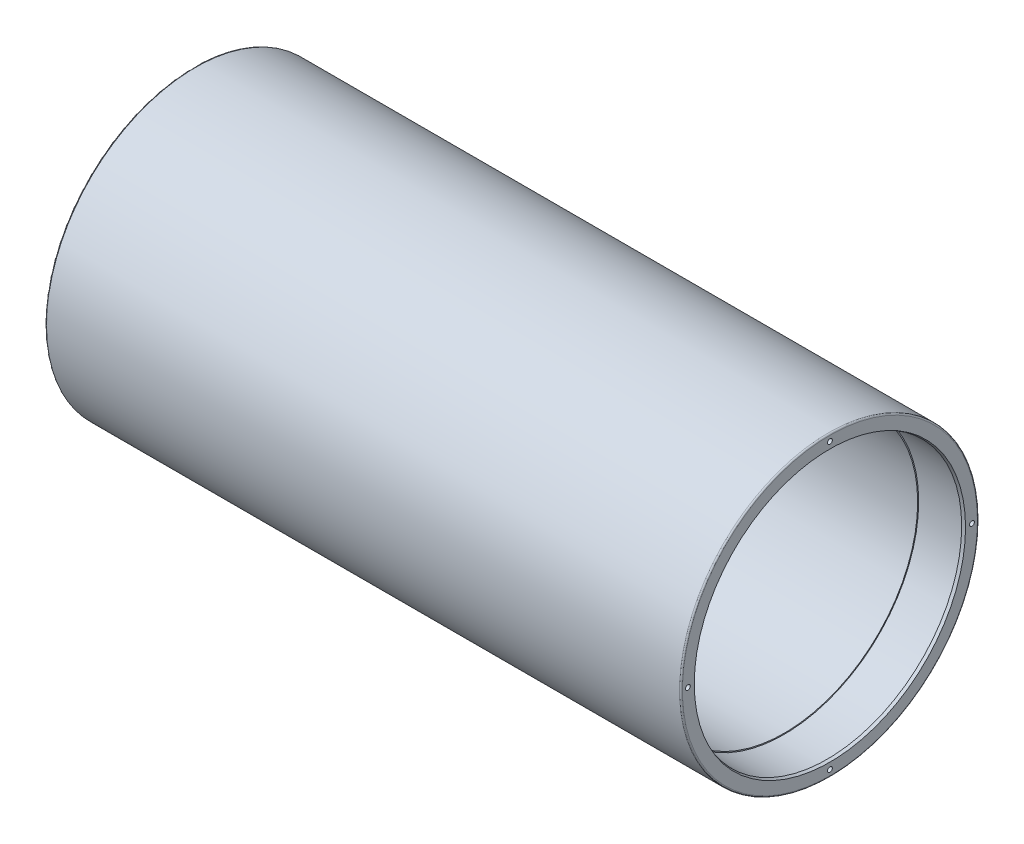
from build123d import *

# Parameters (mm, degrees)
SKETCH5_W         = 38.573447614
SKETCH5_H         = 6.968946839
CIRPATTERN1_COUNT = 4
CHAMFER1_SIZE     = 1.5748
CHAMFER1_SIZE2    = 0.573180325
CHAMFER2_SIZE     = 1.5748
CHAMFER2_SIZE2    = 0.573180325
FILLET1_R         = 0.79375


with BuildPart() as part:
    # Sketch2 → Revolve1 (revolve)
    with BuildSketch(Plane.XY, mode=Mode.PRIVATE) as revolve1_sk:
        Polygon((0, 82.55), (0, 66.675), (18.569070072, 66.675), (46.05935632, 74.041), (352.425, 74.041), (352.425, 82.55), align=None)
    revolve(revolve1_sk.sketch.rotate(Axis((196.985032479, 0, 0), (-1, 0, 0)), 90), axis=Axis((196.985032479, 0, 0), (-1, 0, 0)))

    # Sketch5 → Cut-Revolve1 (revolve, cut)
    with BuildSketch(Plane.XY, mode=Mode.PRIVATE) as cut_revolve1_sk:
        with Locations((346.311723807, 71.128026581)):
            Rectangle(SKETCH5_W, SKETCH5_H)
    revolve(cut_revolve1_sk.sketch.rotate(Axis((0, 0, 0), (1, 0, 0)), 270), axis=Axis((0, 0, 0), (1, 0, 0)), mode=Mode.SUBTRACT)

    # Sketch4 → 6-32 Tapped Hole1 (revolve, cut)
    with BuildSketch(Plane.ZX.offset(78.74)):
        Polygon((0, 0), (0, 10.21069403), (1.35255, 9.398), (1.35255, 0), align=None)
    f_6_32_tapped_hole1 = revolve(axis=Axis((-6.35, 78.74, 0), (1, 0, 0)), mode=Mode.SUBTRACT)

    # CirPattern1: 6-32 Tapped Hole1 ×4 about axis
    cirpattern1_axis = Axis((0, 0, 0), (1, 0, 0))
    for i in range(1, CIRPATTERN1_COUNT):
        add(f_6_32_tapped_hole1.rotate(cirpattern1_axis, i * 360 / CIRPATTERN1_COUNT), mode=Mode.SUBTRACT)

    # Mirror1: 6-32 Tapped Hole1 across plane
    add(f_6_32_tapped_hole1.mirror(Plane.ZY.offset(-176.2125)), mode=Mode.SUBTRACT)

    # Mirror1 copy 1 sketch → Mirror1 copy 1 (revolve, cut)
    with BuildSketch(Plane(origin=(352.425, 0, 78.74), x_dir=(0, -1, 0), z_dir=(0, 0, 1))):
        Polygon((0, 0), (0, -10.21069403), (1.35255, -9.398), (1.35255, 0), align=None)
    revolve(axis=Axis((358.775, 0, 78.74), (1, 0, 0)), mode=Mode.SUBTRACT)

    # Mirror1 copy 2 sketch → Mirror1 copy 2 (revolve, cut)
    with BuildSketch(Plane(origin=(352.425, -78.74, 0), x_dir=(0, 0, -1), z_dir=(0, -1, 0))):
        Polygon((0, 0), (0, -10.21069403), (1.35255, -9.398), (1.35255, 0), align=None)
    revolve(axis=Axis((358.775, -78.74, 0), (1, 0, 0)), mode=Mode.SUBTRACT)

    # Mirror1 copy 3 sketch → Mirror1 copy 3 (revolve, cut)
    with BuildSketch(Plane(origin=(352.425, 0, -78.74), x_dir=(0, 1, 0), z_dir=(0, 0, -1))):
        Polygon((0, 0), (0, -10.21069403), (1.35255, -9.398), (1.35255, 0), align=None)
    revolve(axis=Axis((358.775, 0, -78.74), (1, 0, 0)), mode=Mode.SUBTRACT)

    # Chamfer1
    chamfer1_edges = [part.edges().sort_by_distance(p)[0] for p in [
        (0, 0, 66.675),
    ]]
    chamfer1_side = [part.faces().sort_by_distance(p)[0] for p in [
        (9.284535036, 0, 66.675),
    ]]
    chamfer(chamfer1_edges, length=CHAMFER1_SIZE, length2=CHAMFER1_SIZE2, reference=chamfer1_side[0])

    # Chamfer2
    chamfer2_edges = [part.edges().sort_by_distance(p)[0] for p in [
        (352.425, 0, 74.6125),
    ]]
    chamfer2_side = [part.faces().sort_by_distance(p)[0] for p in [
        (339.725, 0, 74.6125),
    ]]
    chamfer(chamfer2_edges, length=CHAMFER2_SIZE, length2=CHAMFER2_SIZE2, reference=chamfer2_side[0])

    # Fillet1
    fillet1_edges = [part.edges().sort_by_distance(p)[0] for p in [
        (352.425, 0, 82.55),
        (0, 0, 82.55),
    ]]
    fillet(fillet1_edges, radius=FILLET1_R)


solid = part.part
